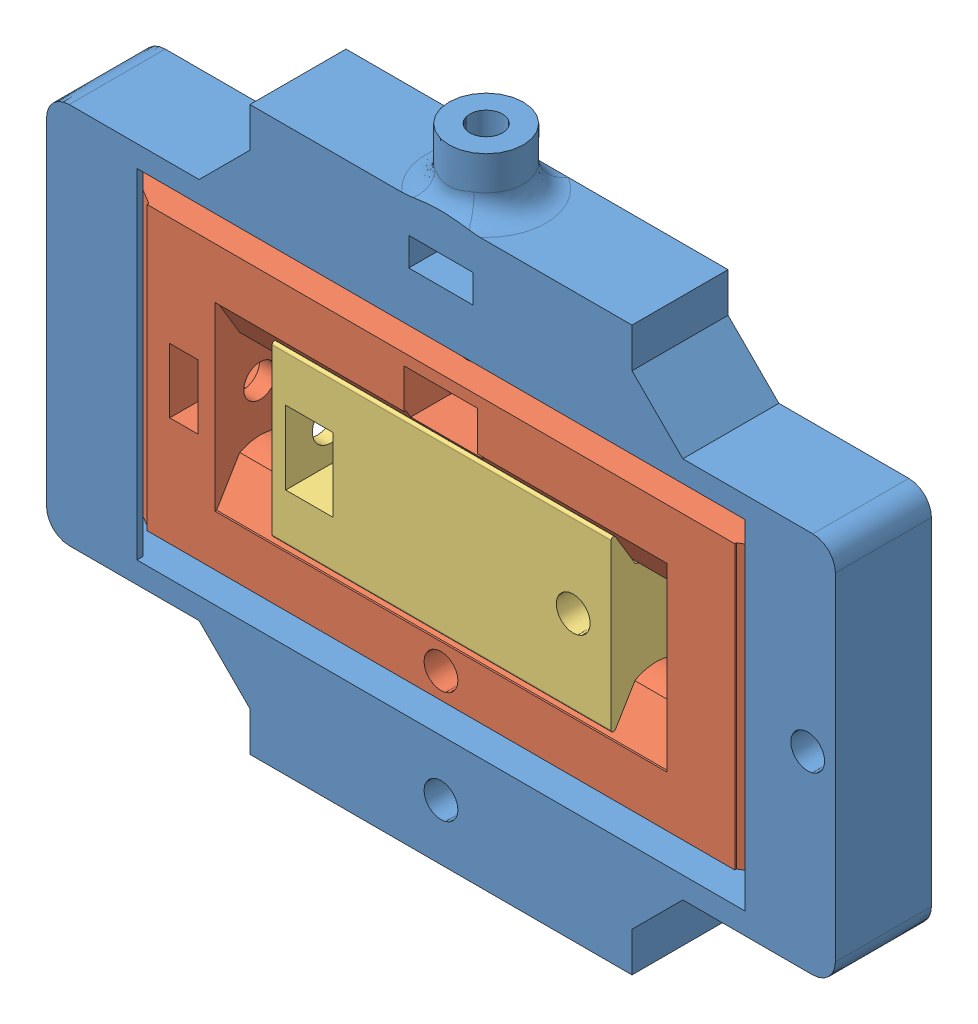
SolidWorks assembly Baugr1_0.15.SLDASM, configuration Standard (file format 15000). Lengths in mm.
Overall size (69.8 54.8 10.5).
3 component instances, 3 part files, 4 mates.
Components (placement in the parent):
- xyStage_inset-1: xyStage_inset.SLDPRT [Standard] at (-0.7234 -2.2365 -5.8866) size (69.8 54.8 8.5)
- xyStage_ySlide-1: xyStage_ySlide.SLDPRT [Standard] at (-0.7234 -14.5454 -1.3866) size (59.7 25 8.6)
- xyStage_xSlide-1: xyStage_xSlide.SLDPRT [Standard] at (-0.66 -2.0454 -1.3866) x (0 0 -1) z (1 0 0) size (10.5 14.96 30)
Mates (geometry in assembly coordinates):
- Konzentrisch7: concentric anti-aligned: cylinder of xyStage_ySlide-1 through (-20.7234 5.9546 -1.3866) axis (1 0 0) radius 3.85; cylinder of xyStage_xSlide-1 through (14.34 5.9546 -1.3866) axis (-1 0 0) radius 4
- Konzentrisch10: concentric anti-aligned: cylinder of xyStage_ySlide-1 through (-20.7234 -10.0454 -1.3866) axis (1 0 0) radius 3.85; cylinder of xyStage_xSlide-1 through (14.34 -10.0454 -1.3866) axis (-1 0 0) radius 4
- Konzentrisch12: concentric aligned: cylinder of xyStage_inset-1 through (25.2766 73.2945 -1.3866) axis (0 -1 0) radius 4; cylinder of xyStage_ySlide-1 through (25.2766 10.4546 -1.3866) axis (0 -1 0) radius 3.85
- Konzentrisch13: concentric aligned: cylinder of xyStage_inset-1 through (-26.7234 73.2945 -1.3866) axis (0 -1 0) radius 4; cylinder of xyStage_ySlide-1 through (-26.7234 10.4546 -1.3866) axis (0 -1 0) radius 3.85
